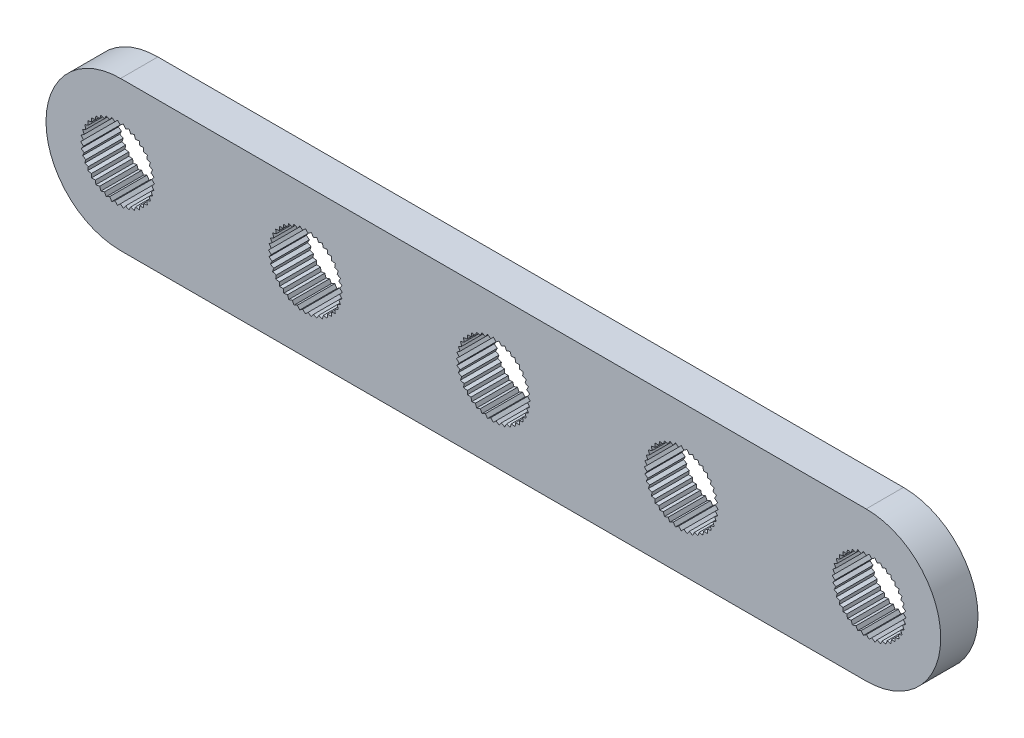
from build123d import *

# Parameters (mm, degrees)
BOSS_EXTRUDE1_DEPTH = 3.175


with BuildPart() as part:
    # Sketch1 (on Front Plane) → Boss-Extrude1 (new body)
    with BuildSketch(Plane.XY):
        with BuildLine():
            Line((-31.75, 6.35), (31.75, 6.35))
            ThreePointArc((31.75, 6.35), (38.1, 0), (31.75, -6.35))
            Line((31.75, -6.35), (-31.75, -6.35))
            ThreePointArc((-31.75, -6.35), (-38.1, 0), (-31.75, 6.35))
        make_face()
        Polygon((3.140814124, 0), (2.911661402, 0.229152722), (3.10214549, 0.491331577), (2.839966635, 0.681815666), (2.987091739, 0.97056494), (2.698342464, 1.117690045), (2.798485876, 1.425899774), (2.490276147, 1.526043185), (2.540972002, 1.846124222), (2.220890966, 1.896820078), (2.220890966, 2.220890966), (1.896820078, 2.220890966), (1.846124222, 2.540972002), (1.526043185, 2.490276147), (1.425899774, 2.798485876), (1.117690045, 2.698342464), (0.97056494, 2.987091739), (0.681815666, 2.839966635), (0.491331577, 3.10214549), (0.229152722, 2.911661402), (0, 3.140814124), (-0.229152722, 2.911661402), (-0.491331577, 3.10214549), (-0.681815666, 2.839966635), (-0.97056494, 2.987091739), (-1.117690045, 2.698342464), (-1.425899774, 2.798485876), (-1.526043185, 2.490276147), (-1.846124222, 2.540972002), (-1.896820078, 2.220890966), (-2.220890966, 2.220890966), (-2.220890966, 1.896820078), (-2.540972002, 1.846124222), (-2.490276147, 1.526043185), (-2.798485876, 1.425899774), (-2.698342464, 1.117690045), (-2.987091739, 0.97056494), (-2.839966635, 0.681815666), (-3.10214549, 0.491331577), (-2.911661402, 0.229152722), (-3.140814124, 0), (-2.911661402, -0.229152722), (-3.10214549, -0.491331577), (-2.839966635, -0.681815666), (-2.987091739, -0.97056494), (-2.698342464, -1.117690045), (-2.798485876, -1.425899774), (-2.490276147, -1.526043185), (-2.540972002, -1.846124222), (-2.220890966, -1.896820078), (-2.220890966, -2.220890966), (-1.896820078, -2.220890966), (-1.846124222, -2.540972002), (-1.526043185, -2.490276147), (-1.425899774, -2.798485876), (-1.117690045, -2.698342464), (-0.97056494, -2.987091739), (-0.681815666, -2.839966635), (-0.491331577, -3.10214549), (-0.229152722, -2.911661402), (0, -3.140814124), (0.229152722, -2.911661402), (0.491331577, -3.10214549), (0.681815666, -2.839966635), (0.97056494, -2.987091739), (1.117690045, -2.698342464), (1.425899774, -2.798485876), (1.526043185, -2.490276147), (1.846124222, -2.540972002), (1.896820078, -2.220890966), (2.220890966, -2.220890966), (2.220890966, -1.896820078), (2.540972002, -1.846124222), (2.490276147, -1.526043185), (2.798485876, -1.425899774), (2.698342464, -1.117690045), (2.987091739, -0.97056494), (2.839966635, -0.681815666), (3.10214549, -0.491331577), (2.911661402, -0.229152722), align=None, mode=Mode.SUBTRACT)
        Polygon((19.142814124, 0), (18.913661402, 0.229152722), (19.10414549, 0.491331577), (18.841966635, 0.681815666), (18.989091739, 0.97056494), (18.700342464, 1.117690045), (18.800485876, 1.425899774), (18.492276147, 1.526043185), (18.542972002, 1.846124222), (18.222890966, 1.896820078), (18.222890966, 2.220890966), (17.898820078, 2.220890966), (17.848124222, 2.540972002), (17.528043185, 2.490276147), (17.427899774, 2.798485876), (17.119690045, 2.698342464), (16.97256494, 2.987091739), (16.683815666, 2.839966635), (16.493331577, 3.10214549), (16.231152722, 2.911661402), (16.002, 3.140814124), (15.772847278, 2.911661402), (15.510668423, 3.10214549), (15.320184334, 2.839966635), (15.03143506, 2.987091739), (14.884309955, 2.698342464), (14.576100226, 2.798485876), (14.475956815, 2.490276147), (14.155875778, 2.540972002), (14.105179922, 2.220890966), (13.781109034, 2.220890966), (13.781109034, 1.896820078), (13.461027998, 1.846124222), (13.511723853, 1.526043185), (13.203514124, 1.425899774), (13.303657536, 1.117690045), (13.014908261, 0.97056494), (13.162033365, 0.681815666), (12.89985451, 0.491331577), (13.090338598, 0.229152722), (12.861185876, 0), (13.090338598, -0.229152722), (12.89985451, -0.491331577), (13.162033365, -0.681815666), (13.014908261, -0.97056494), (13.303657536, -1.117690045), (13.203514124, -1.425899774), (13.511723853, -1.526043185), (13.461027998, -1.846124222), (13.781109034, -1.896820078), (13.781109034, -2.220890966), (14.105179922, -2.220890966), (14.155875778, -2.540972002), (14.475956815, -2.490276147), (14.576100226, -2.798485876), (14.884309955, -2.698342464), (15.03143506, -2.987091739), (15.320184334, -2.839966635), (15.510668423, -3.10214549), (15.772847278, -2.911661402), (16.002, -3.140814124), (16.231152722, -2.911661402), (16.493331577, -3.10214549), (16.683815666, -2.839966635), (16.97256494, -2.987091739), (17.119690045, -2.698342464), (17.427899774, -2.798485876), (17.528043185, -2.490276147), (17.848124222, -2.540972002), (17.898820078, -2.220890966), (18.222890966, -2.220890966), (18.222890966, -1.896820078), (18.542972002, -1.846124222), (18.492276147, -1.526043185), (18.800485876, -1.425899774), (18.700342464, -1.117690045), (18.989091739, -0.97056494), (18.841966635, -0.681815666), (19.10414549, -0.491331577), (18.913661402, -0.229152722), align=None, mode=Mode.SUBTRACT)
        Polygon((35.144814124, 0), (34.915661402, 0.229152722), (35.10614549, 0.491331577), (34.843966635, 0.681815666), (34.991091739, 0.97056494), (34.702342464, 1.117690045), (34.802485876, 1.425899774), (34.494276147, 1.526043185), (34.544972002, 1.846124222), (34.224890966, 1.896820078), (34.224890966, 2.220890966), (33.900820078, 2.220890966), (33.850124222, 2.540972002), (33.530043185, 2.490276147), (33.429899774, 2.798485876), (33.121690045, 2.698342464), (32.97456494, 2.987091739), (32.685815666, 2.839966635), (32.495331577, 3.10214549), (32.233152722, 2.911661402), (32.004, 3.140814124), (31.774847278, 2.911661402), (31.512668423, 3.10214549), (31.322184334, 2.839966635), (31.03343506, 2.987091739), (30.886309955, 2.698342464), (30.578100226, 2.798485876), (30.477956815, 2.490276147), (30.157875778, 2.540972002), (30.107179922, 2.220890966), (29.783109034, 2.220890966), (29.783109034, 1.896820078), (29.463027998, 1.846124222), (29.513723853, 1.526043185), (29.205514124, 1.425899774), (29.305657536, 1.117690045), (29.016908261, 0.97056494), (29.164033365, 0.681815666), (28.90185451, 0.491331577), (29.092338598, 0.229152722), (28.863185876, 0), (29.092338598, -0.229152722), (28.90185451, -0.491331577), (29.164033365, -0.681815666), (29.016908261, -0.97056494), (29.305657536, -1.117690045), (29.205514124, -1.425899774), (29.513723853, -1.526043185), (29.463027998, -1.846124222), (29.783109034, -1.896820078), (29.783109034, -2.220890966), (30.107179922, -2.220890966), (30.157875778, -2.540972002), (30.477956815, -2.490276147), (30.578100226, -2.798485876), (30.886309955, -2.698342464), (31.03343506, -2.987091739), (31.322184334, -2.839966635), (31.512668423, -3.10214549), (31.774847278, -2.911661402), (32.004, -3.140814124), (32.233152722, -2.911661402), (32.495331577, -3.10214549), (32.685815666, -2.839966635), (32.97456494, -2.987091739), (33.121690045, -2.698342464), (33.429899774, -2.798485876), (33.530043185, -2.490276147), (33.850124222, -2.540972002), (33.900820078, -2.220890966), (34.224890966, -2.220890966), (34.224890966, -1.896820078), (34.544972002, -1.846124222), (34.494276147, -1.526043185), (34.802485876, -1.425899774), (34.702342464, -1.117690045), (34.991091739, -0.97056494), (34.843966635, -0.681815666), (35.10614549, -0.491331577), (34.915661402, -0.229152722), align=None, mode=Mode.SUBTRACT)
        Polygon((-12.861185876, 0), (-13.090338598, 0.229152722), (-12.89985451, 0.491331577), (-13.162033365, 0.681815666), (-13.014908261, 0.97056494), (-13.303657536, 1.117690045), (-13.203514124, 1.425899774), (-13.511723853, 1.526043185), (-13.461027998, 1.846124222), (-13.781109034, 1.896820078), (-13.781109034, 2.220890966), (-14.105179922, 2.220890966), (-14.155875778, 2.540972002), (-14.475956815, 2.490276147), (-14.576100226, 2.798485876), (-14.884309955, 2.698342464), (-15.03143506, 2.987091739), (-15.320184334, 2.839966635), (-15.510668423, 3.10214549), (-15.772847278, 2.911661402), (-16.002, 3.140814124), (-16.231152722, 2.911661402), (-16.493331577, 3.10214549), (-16.683815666, 2.839966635), (-16.97256494, 2.987091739), (-17.119690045, 2.698342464), (-17.427899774, 2.798485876), (-17.528043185, 2.490276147), (-17.848124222, 2.540972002), (-17.898820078, 2.220890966), (-18.222890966, 2.220890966), (-18.222890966, 1.896820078), (-18.542972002, 1.846124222), (-18.492276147, 1.526043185), (-18.800485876, 1.425899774), (-18.700342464, 1.117690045), (-18.989091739, 0.97056494), (-18.841966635, 0.681815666), (-19.10414549, 0.491331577), (-18.913661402, 0.229152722), (-19.142814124, 0), (-18.913661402, -0.229152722), (-19.10414549, -0.491331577), (-18.841966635, -0.681815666), (-18.989091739, -0.97056494), (-18.700342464, -1.117690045), (-18.800485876, -1.425899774), (-18.492276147, -1.526043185), (-18.542972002, -1.846124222), (-18.222890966, -1.896820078), (-18.222890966, -2.220890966), (-17.898820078, -2.220890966), (-17.848124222, -2.540972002), (-17.528043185, -2.490276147), (-17.427899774, -2.798485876), (-17.119690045, -2.698342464), (-16.97256494, -2.987091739), (-16.683815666, -2.839966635), (-16.493331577, -3.10214549), (-16.231152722, -2.911661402), (-16.002, -3.140814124), (-15.772847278, -2.911661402), (-15.510668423, -3.10214549), (-15.320184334, -2.839966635), (-15.03143506, -2.987091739), (-14.884309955, -2.698342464), (-14.576100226, -2.798485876), (-14.475956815, -2.490276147), (-14.155875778, -2.540972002), (-14.105179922, -2.220890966), (-13.781109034, -2.220890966), (-13.781109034, -1.896820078), (-13.461027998, -1.846124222), (-13.511723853, -1.526043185), (-13.203514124, -1.425899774), (-13.303657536, -1.117690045), (-13.014908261, -0.97056494), (-13.162033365, -0.681815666), (-12.89985451, -0.491331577), (-13.090338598, -0.229152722), align=None, mode=Mode.SUBTRACT)
        Polygon((-28.863185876, 0), (-29.092338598, 0.229152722), (-28.90185451, 0.491331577), (-29.164033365, 0.681815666), (-29.016908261, 0.97056494), (-29.305657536, 1.117690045), (-29.205514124, 1.425899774), (-29.513723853, 1.526043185), (-29.463027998, 1.846124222), (-29.783109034, 1.896820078), (-29.783109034, 2.220890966), (-30.107179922, 2.220890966), (-30.157875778, 2.540972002), (-30.477956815, 2.490276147), (-30.578100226, 2.798485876), (-30.886309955, 2.698342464), (-31.03343506, 2.987091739), (-31.322184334, 2.839966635), (-31.512668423, 3.10214549), (-31.774847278, 2.911661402), (-32.004, 3.140814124), (-32.233152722, 2.911661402), (-32.495331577, 3.10214549), (-32.685815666, 2.839966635), (-32.97456494, 2.987091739), (-33.121690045, 2.698342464), (-33.429899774, 2.798485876), (-33.530043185, 2.490276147), (-33.850124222, 2.540972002), (-33.900820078, 2.220890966), (-34.224890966, 2.220890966), (-34.224890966, 1.896820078), (-34.544972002, 1.846124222), (-34.494276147, 1.526043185), (-34.802485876, 1.425899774), (-34.702342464, 1.117690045), (-34.991091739, 0.97056494), (-34.843966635, 0.681815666), (-35.10614549, 0.491331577), (-34.915661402, 0.229152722), (-35.144814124, 0), (-34.915661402, -0.229152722), (-35.10614549, -0.491331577), (-34.843966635, -0.681815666), (-34.991091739, -0.97056494), (-34.702342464, -1.117690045), (-34.802485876, -1.425899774), (-34.494276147, -1.526043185), (-34.544972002, -1.846124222), (-34.224890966, -1.896820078), (-34.224890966, -2.220890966), (-33.900820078, -2.220890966), (-33.850124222, -2.540972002), (-33.530043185, -2.490276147), (-33.429899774, -2.798485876), (-33.121690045, -2.698342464), (-32.97456494, -2.987091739), (-32.685815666, -2.839966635), (-32.495331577, -3.10214549), (-32.233152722, -2.911661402), (-32.004, -3.140814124), (-31.774847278, -2.911661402), (-31.512668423, -3.10214549), (-31.322184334, -2.839966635), (-31.03343506, -2.987091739), (-30.886309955, -2.698342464), (-30.578100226, -2.798485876), (-30.477956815, -2.490276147), (-30.157875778, -2.540972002), (-30.107179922, -2.220890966), (-29.783109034, -2.220890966), (-29.783109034, -1.896820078), (-29.463027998, -1.846124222), (-29.513723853, -1.526043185), (-29.205514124, -1.425899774), (-29.305657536, -1.117690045), (-29.016908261, -0.97056494), (-29.164033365, -0.681815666), (-28.90185451, -0.491331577), (-29.092338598, -0.229152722), align=None, mode=Mode.SUBTRACT)
    extrude(amount=BOSS_EXTRUDE1_DEPTH)


solid = part.part
